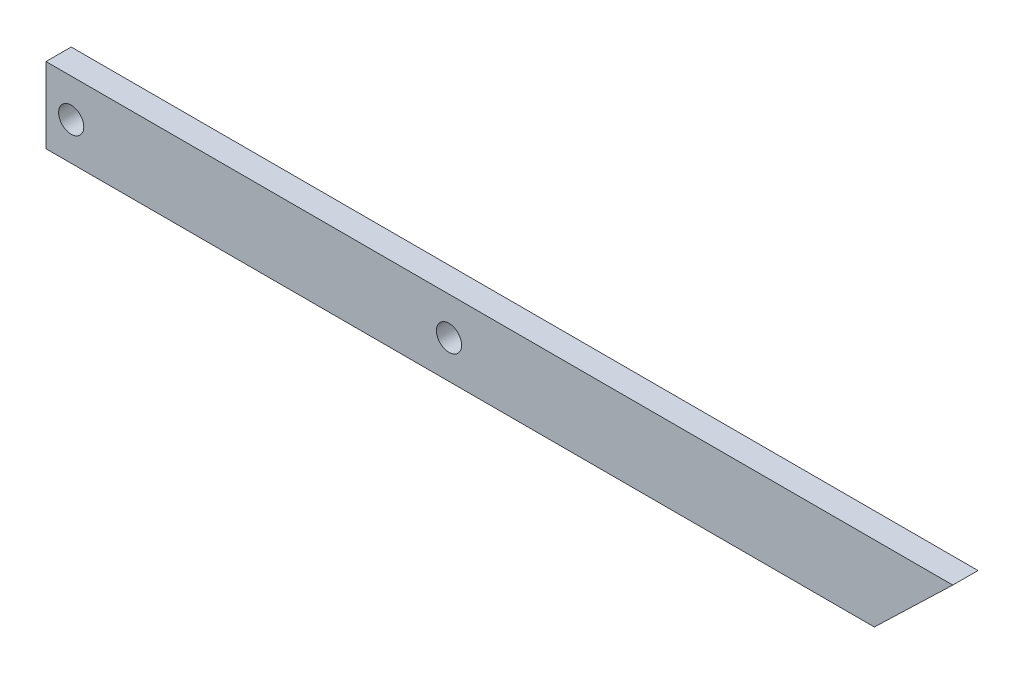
ISO-10303-21;
HEADER;
FILE_DESCRIPTION(('STEP AP214'),'2;1');
FILE_NAME('part.step','',(''),(''),'','','');
FILE_SCHEMA(('AUTOMOTIVE_DESIGN { 1 0 10303 214 1 1 1 1 }'));
ENDSEC;
DATA;
#1=APPLICATION_CONTEXT('core data for automotive mechanical design processes');
#2=APPLICATION_PROTOCOL_DEFINITION('international standard','automotive_design',2000,#1);
#3=PRODUCT_CONTEXT('',#1,'mechanical');
#4=PRODUCT('Part','Part','',(#3));
#5=PRODUCT_RELATED_PRODUCT_CATEGORY('part','',(#4));
#6=PRODUCT_DEFINITION_FORMATION('','',#4);
#7=PRODUCT_DEFINITION_CONTEXT('part definition',#1,'design');
#8=PRODUCT_DEFINITION('design','',#6,#7);
#9=PRODUCT_DEFINITION_SHAPE('','',#8);
#10=(LENGTH_UNIT() NAMED_UNIT(*) SI_UNIT(.MILLI.,.METRE.));
#11=(NAMED_UNIT(*) PLANE_ANGLE_UNIT() SI_UNIT($,.RADIAN.));
#12=(NAMED_UNIT(*) SI_UNIT($,.STERADIAN.) SOLID_ANGLE_UNIT());
#13=UNCERTAINTY_MEASURE_WITH_UNIT(LENGTH_MEASURE(1.E-05),#10,'distance_accuracy_value','');
#14=(GEOMETRIC_REPRESENTATION_CONTEXT(3) GLOBAL_UNCERTAINTY_ASSIGNED_CONTEXT((#13)) GLOBAL_UNIT_ASSIGNED_CONTEXT((#10,
#11,#12)) REPRESENTATION_CONTEXT('',''));
#15=CARTESIAN_POINT('',(0.,0.,0.));
#16=DIRECTION('',(0.,0.,1.));
#17=DIRECTION('',(1.,0.,0.));
#18=AXIS2_PLACEMENT_3D('',#15,#16,#17);
#19=CARTESIAN_POINT('',(-100.,0.,10.));
#20=DIRECTION('',(0.,0.,1.));
#21=DIRECTION('',(1.,0.,0.));
#22=AXIS2_PLACEMENT_3D('',#19,#20,#21);
#23=PLANE('',#22);
#24=CARTESIAN_POINT('',(-90.,15.,10.));
#25=DIRECTION('',(0.,0.,1.));
#26=DIRECTION('',(1.,0.,0.));
#27=AXIS2_PLACEMENT_3D('',#24,#25,#26);
#28=CIRCLE('',#27,5.);
#29=CARTESIAN_POINT('',(-85.,15.,10.));
#30=VERTEX_POINT('',#29);
#31=EDGE_CURVE('E97',#30,#30,#28,.T.);
#32=ORIENTED_EDGE('',*,*,#31,.F.);
#33=EDGE_LOOP('',(#32));
#34=FACE_BOUND('',#33,.T.);
#35=DIRECTION('',(0.,-1.,0.));
#36=VECTOR('',#35,1.);
#37=CARTESIAN_POINT('',(-100.,30.,10.));
#38=LINE('',#37,#36);
#39=CARTESIAN_POINT('',(-100.,30.,10.));
#40=VERTEX_POINT('',#39);
#41=CARTESIAN_POINT('',(-100.,0.,10.));
#42=VERTEX_POINT('',#41);
#43=EDGE_CURVE('E82',#40,#42,#38,.T.);
#44=ORIENTED_EDGE('',*,*,#43,.T.);
#45=DIRECTION('',(1.,0.,0.));
#46=VECTOR('',#45,1.);
#47=CARTESIAN_POINT('',(-100.,0.,10.));
#48=LINE('',#47,#46);
#49=CARTESIAN_POINT('',(228.842012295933,0.,10.));
#50=VERTEX_POINT('',#49);
#51=EDGE_CURVE('E77',#42,#50,#48,.T.);
#52=ORIENTED_EDGE('',*,*,#51,.T.);
#53=DIRECTION('',(0.720366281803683,0.693593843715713,0.));
#54=VECTOR('',#53,1.);
#55=CARTESIAN_POINT('',(260.,30.,10.));
#56=LINE('',#55,#54);
#57=CARTESIAN_POINT('',(260.,30.,10.));
#58=VERTEX_POINT('',#57);
#59=EDGE_CURVE('E80',#50,#58,#56,.T.);
#60=ORIENTED_EDGE('',*,*,#59,.T.);
#61=DIRECTION('',(-1.,0.,0.));
#62=VECTOR('',#61,1.);
#63=CARTESIAN_POINT('',(-100.,30.,10.));
#64=LINE('',#63,#62);
#65=EDGE_CURVE('E47',#58,#40,#64,.T.);
#66=ORIENTED_EDGE('',*,*,#65,.T.);
#67=EDGE_LOOP('',(#44,#52,#60,#66));
#68=FACE_BOUND('',#67,.T.);
#69=CARTESIAN_POINT('',(60.,15.,10.));
#70=DIRECTION('',(0.,0.,1.));
#71=DIRECTION('',(1.,0.,0.));
#72=AXIS2_PLACEMENT_3D('',#69,#70,#71);
#73=CIRCLE('',#72,5.);
#74=CARTESIAN_POINT('',(65.,15.,10.));
#75=VERTEX_POINT('',#74);
#76=EDGE_CURVE('E112',#75,#75,#73,.T.);
#77=ORIENTED_EDGE('',*,*,#76,.F.);
#78=EDGE_LOOP('',(#77));
#79=FACE_BOUND('',#78,.T.);
#80=ADVANCED_FACE('F30',(#34,#68,#79),#23,.T.);
#81=CARTESIAN_POINT('',(-100.,0.,0.));
#82=DIRECTION('',(0.,0.,1.));
#83=DIRECTION('',(1.,0.,0.));
#84=AXIS2_PLACEMENT_3D('',#81,#82,#83);
#85=PLANE('',#84);
#86=CARTESIAN_POINT('',(-90.,15.,0.));
#87=DIRECTION('',(0.,0.,1.));
#88=DIRECTION('',(1.,0.,0.));
#89=AXIS2_PLACEMENT_3D('',#86,#87,#88);
#90=CIRCLE('',#89,5.);
#91=CARTESIAN_POINT('',(-85.,15.,0.));
#92=VERTEX_POINT('',#91);
#93=EDGE_CURVE('E109',#92,#92,#90,.T.);
#94=ORIENTED_EDGE('',*,*,#93,.T.);
#95=EDGE_LOOP('',(#94));
#96=FACE_BOUND('',#95,.T.);
#97=DIRECTION('',(0.,-1.,0.));
#98=VECTOR('',#97,1.);
#99=CARTESIAN_POINT('',(-100.,30.,0.));
#100=LINE('',#99,#98);
#101=CARTESIAN_POINT('',(-100.,30.,0.));
#102=VERTEX_POINT('',#101);
#103=CARTESIAN_POINT('',(-100.,0.,0.));
#104=VERTEX_POINT('',#103);
#105=EDGE_CURVE('E94',#102,#104,#100,.T.);
#106=ORIENTED_EDGE('',*,*,#105,.F.);
#107=DIRECTION('',(-1.,0.,0.));
#108=VECTOR('',#107,1.);
#109=CARTESIAN_POINT('',(-100.,30.,0.));
#110=LINE('',#109,#108);
#111=CARTESIAN_POINT('',(260.,30.,0.));
#112=VERTEX_POINT('',#111);
#113=EDGE_CURVE('E70',#112,#102,#110,.T.);
#114=ORIENTED_EDGE('',*,*,#113,.F.);
#115=DIRECTION('',(0.720366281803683,0.693593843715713,0.));
#116=VECTOR('',#115,1.);
#117=CARTESIAN_POINT('',(260.,30.,0.));
#118=LINE('',#117,#116);
#119=CARTESIAN_POINT('',(228.842012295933,0.,0.));
#120=VERTEX_POINT('',#119);
#121=EDGE_CURVE('E64',#120,#112,#118,.T.);
#122=ORIENTED_EDGE('',*,*,#121,.F.);
#123=DIRECTION('',(1.,0.,0.));
#124=VECTOR('',#123,1.);
#125=CARTESIAN_POINT('',(-100.,0.,0.));
#126=LINE('',#125,#124);
#127=EDGE_CURVE('E86',#104,#120,#126,.T.);
#128=ORIENTED_EDGE('',*,*,#127,.F.);
#129=EDGE_LOOP('',(#106,#114,#122,#128));
#130=FACE_BOUND('',#129,.T.);
#131=CARTESIAN_POINT('',(60.,15.,0.));
#132=DIRECTION('',(0.,0.,1.));
#133=DIRECTION('',(1.,0.,0.));
#134=AXIS2_PLACEMENT_3D('',#131,#132,#133);
#135=CIRCLE('',#134,5.);
#136=CARTESIAN_POINT('',(65.,15.,0.));
#137=VERTEX_POINT('',#136);
#138=EDGE_CURVE('E115',#137,#137,#135,.T.);
#139=ORIENTED_EDGE('',*,*,#138,.T.);
#140=EDGE_LOOP('',(#139));
#141=FACE_BOUND('',#140,.T.);
#142=ADVANCED_FACE('F105',(#96,#130,#141),#85,.F.);
#143=CARTESIAN_POINT('',(-100.,30.,10.));
#144=DIRECTION('',(1.,0.,0.));
#145=DIRECTION('',(0.,0.,-1.));
#146=AXIS2_PLACEMENT_3D('',#143,#144,#145);
#147=PLANE('',#146);
#148=ORIENTED_EDGE('',*,*,#105,.T.);
#149=DIRECTION('',(0.,0.,-1.));
#150=VECTOR('',#149,1.);
#151=CARTESIAN_POINT('',(-100.,0.,10.));
#152=LINE('',#151,#150);
#153=EDGE_CURVE('E11',#42,#104,#152,.T.);
#154=ORIENTED_EDGE('',*,*,#153,.F.);
#155=ORIENTED_EDGE('',*,*,#43,.F.);
#156=DIRECTION('',(0.,0.,-1.));
#157=VECTOR('',#156,1.);
#158=CARTESIAN_POINT('',(-100.,30.,10.));
#159=LINE('',#158,#157);
#160=EDGE_CURVE('E90',#40,#102,#159,.T.);
#161=ORIENTED_EDGE('',*,*,#160,.T.);
#162=EDGE_LOOP('',(#148,#154,#155,#161));
#163=FACE_BOUND('',#162,.T.);
#164=ADVANCED_FACE('F32',(#163),#147,.F.);
#165=CARTESIAN_POINT('',(-100.,0.,10.));
#166=DIRECTION('',(0.,1.,0.));
#167=DIRECTION('',(0.,0.,1.));
#168=AXIS2_PLACEMENT_3D('',#165,#166,#167);
#169=PLANE('',#168);
#170=ORIENTED_EDGE('',*,*,#127,.T.);
#171=DIRECTION('',(0.,0.,-1.));
#172=VECTOR('',#171,1.);
#173=CARTESIAN_POINT('',(228.842012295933,0.,10.));
#174=LINE('',#173,#172);
#175=EDGE_CURVE('E39',#50,#120,#174,.T.);
#176=ORIENTED_EDGE('',*,*,#175,.F.);
#177=ORIENTED_EDGE('',*,*,#51,.F.);
#178=ORIENTED_EDGE('',*,*,#153,.T.);
#179=EDGE_LOOP('',(#170,#176,#177,#178));
#180=FACE_BOUND('',#179,.T.);
#181=ADVANCED_FACE('F85',(#180),#169,.F.);
#182=CARTESIAN_POINT('',(260.,30.,10.));
#183=DIRECTION('',(-0.693593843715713,0.720366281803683,0.));
#184=DIRECTION('',(-0.720366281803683,-0.693593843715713,0.));
#185=AXIS2_PLACEMENT_3D('',#182,#183,#184);
#186=PLANE('',#185);
#187=ORIENTED_EDGE('',*,*,#121,.T.);
#188=DIRECTION('',(0.,0.,-1.));
#189=VECTOR('',#188,1.);
#190=CARTESIAN_POINT('',(260.,30.,10.));
#191=LINE('',#190,#189);
#192=EDGE_CURVE('E87',#58,#112,#191,.T.);
#193=ORIENTED_EDGE('',*,*,#192,.F.);
#194=ORIENTED_EDGE('',*,*,#59,.F.);
#195=ORIENTED_EDGE('',*,*,#175,.T.);
#196=EDGE_LOOP('',(#187,#193,#194,#195));
#197=FACE_BOUND('',#196,.T.);
#198=ADVANCED_FACE('F88',(#197),#186,.F.);
#199=CARTESIAN_POINT('',(-100.,30.,10.));
#200=DIRECTION('',(0.,-1.,0.));
#201=DIRECTION('',(0.,0.,-1.));
#202=AXIS2_PLACEMENT_3D('',#199,#200,#201);
#203=PLANE('',#202);
#204=ORIENTED_EDGE('',*,*,#113,.T.);
#205=ORIENTED_EDGE('',*,*,#160,.F.);
#206=ORIENTED_EDGE('',*,*,#65,.F.);
#207=ORIENTED_EDGE('',*,*,#192,.T.);
#208=EDGE_LOOP('',(#204,#205,#206,#207));
#209=FACE_BOUND('',#208,.T.);
#210=ADVANCED_FACE('F102',(#209),#203,.F.);
#211=CARTESIAN_POINT('',(-90.,15.,10.));
#212=DIRECTION('',(0.,0.,-1.));
#213=DIRECTION('',(-1.,0.,0.));
#214=AXIS2_PLACEMENT_3D('',#211,#212,#213);
#215=CYLINDRICAL_SURFACE('',#214,5.);
#216=ORIENTED_EDGE('',*,*,#31,.T.);
#217=EDGE_LOOP('',(#216));
#218=FACE_BOUND('',#217,.T.);
#219=ORIENTED_EDGE('',*,*,#93,.F.);
#220=EDGE_LOOP('',(#219));
#221=FACE_BOUND('',#220,.T.);
#222=ADVANCED_FACE('F133',(#218,#221),#215,.F.);
#223=CARTESIAN_POINT('',(60.,15.,10.));
#224=DIRECTION('',(0.,0.,-1.));
#225=DIRECTION('',(-1.,0.,0.));
#226=AXIS2_PLACEMENT_3D('',#223,#224,#225);
#227=CYLINDRICAL_SURFACE('',#226,5.);
#228=ORIENTED_EDGE('',*,*,#76,.T.);
#229=EDGE_LOOP('',(#228));
#230=FACE_BOUND('',#229,.T.);
#231=ORIENTED_EDGE('',*,*,#138,.F.);
#232=EDGE_LOOP('',(#231));
#233=FACE_BOUND('',#232,.T.);
#234=ADVANCED_FACE('F121',(#230,#233),#227,.F.);
#235=CLOSED_SHELL('',(#80,#142,#164,#181,#198,#210,#222,#234));
#236=MANIFOLD_SOLID_BREP('B2',#235);
#237=ADVANCED_BREP_SHAPE_REPRESENTATION('',(#18,#236),#14);
#238=SHAPE_DEFINITION_REPRESENTATION(#9,#237);
ENDSEC;
END-ISO-10303-21;
